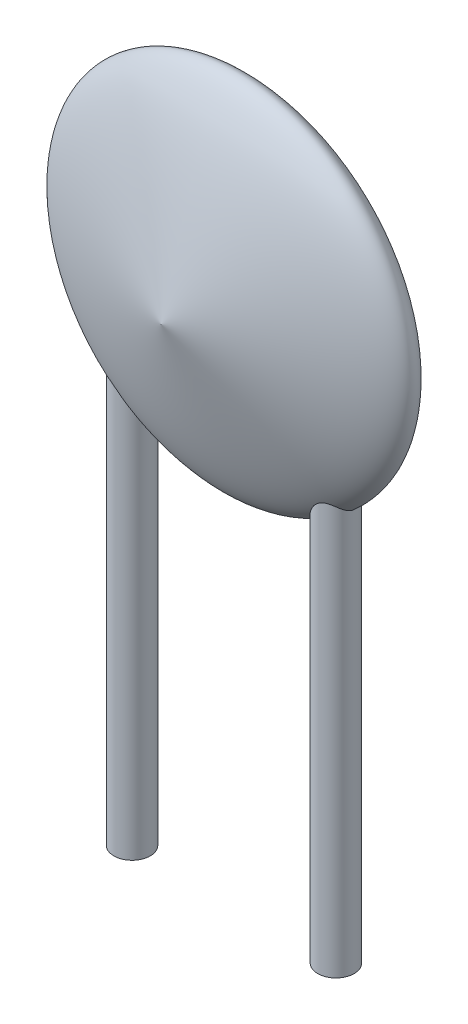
from build123d import *

# Parameters (mm, degrees)
ESQUISSE2_R      = 0.25
EXTRUSION1_DEPTH = 7.4


with BuildPart() as part:
    # Esquisse1 → R_volution1 (revolve)
    with BuildSketch(Plane(origin=(0, 0, 0), x_dir=(0, 0, -1), z_dir=(1, 0, 0))):
        with BuildLine():
            Line((-1, 0), (1, 0))
            add(Edge.make_bspline(
                [(-1, 0), (-0.666666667, 1.25), (0, 3.75), (0.666666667, 1.25), (1, 0)],
                knots=[0, 0, 0, 0, 0.5, 1, 1, 1, 1], degree=3))
        make_face()
    revolve(axis=Axis((0, 0, 4.802830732), (0, 0, -1)))

    # Esquisse2 → Extrusion1 (add)
    with BuildSketch(Plane(origin=(0, 0, 0), x_dir=(1, 0, 0), z_dir=(0, 1, 0))):
        with Locations(Location((-1.4, 0, 0), (0, 0, 270))):
            Circle(ESQUISSE2_R)
        with Locations(Location((1.4, 0, 0), (0, 0, 270))):
            Circle(ESQUISSE2_R)
    extrude(amount=-EXTRUSION1_DEPTH)


solid = part.part
